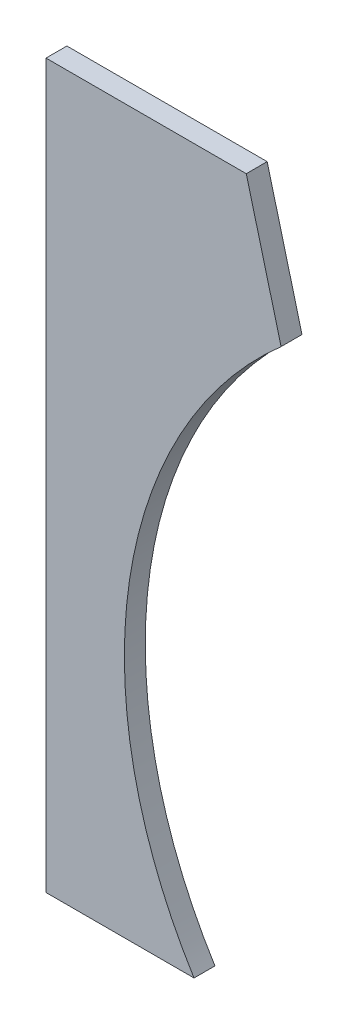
ISO-10303-21;
HEADER;
FILE_DESCRIPTION(('STEP AP214'),'2;1');
FILE_NAME('part.step','',(''),(''),'','','');
FILE_SCHEMA(('AUTOMOTIVE_DESIGN { 1 0 10303 214 1 1 1 1 }'));
ENDSEC;
DATA;
#1=APPLICATION_CONTEXT('core data for automotive mechanical design processes');
#2=APPLICATION_PROTOCOL_DEFINITION('international standard','automotive_design',2000,#1);
#3=PRODUCT_CONTEXT('',#1,'mechanical');
#4=PRODUCT('Part','Part','',(#3));
#5=PRODUCT_RELATED_PRODUCT_CATEGORY('part','',(#4));
#6=PRODUCT_DEFINITION_FORMATION('','',#4);
#7=PRODUCT_DEFINITION_CONTEXT('part definition',#1,'design');
#8=PRODUCT_DEFINITION('design','',#6,#7);
#9=PRODUCT_DEFINITION_SHAPE('','',#8);
#10=(LENGTH_UNIT() NAMED_UNIT(*) SI_UNIT(.MILLI.,.METRE.));
#11=(NAMED_UNIT(*) PLANE_ANGLE_UNIT() SI_UNIT($,.RADIAN.));
#12=(NAMED_UNIT(*) SI_UNIT($,.STERADIAN.) SOLID_ANGLE_UNIT());
#13=UNCERTAINTY_MEASURE_WITH_UNIT(LENGTH_MEASURE(1.E-05),#10,'distance_accuracy_value','');
#14=(GEOMETRIC_REPRESENTATION_CONTEXT(3) GLOBAL_UNCERTAINTY_ASSIGNED_CONTEXT((#13)) GLOBAL_UNIT_ASSIGNED_CONTEXT((#10,
#11,#12)) REPRESENTATION_CONTEXT('',''));
#15=CARTESIAN_POINT('',(0.,0.,0.));
#16=DIRECTION('',(0.,0.,1.));
#17=DIRECTION('',(1.,0.,0.));
#18=AXIS2_PLACEMENT_3D('',#15,#16,#17);
#19=CARTESIAN_POINT('',(310.,0.,12.));
#20=DIRECTION('',(0.,0.,-1.));
#21=DIRECTION('',(-1.,0.,0.));
#22=AXIS2_PLACEMENT_3D('',#19,#20,#21);
#23=CYLINDRICAL_SURFACE('',#22,265.);
#24=CARTESIAN_POINT('',(310.,0.,0.));
#25=DIRECTION('',(0.,0.,-1.));
#26=DIRECTION('',(1.,0.,0.));
#27=AXIS2_PLACEMENT_3D('',#24,#25,#26);
#28=CIRCLE('',#27,265.);
#29=CARTESIAN_POINT('',(85.,-140.,0.));
#30=VERTEX_POINT('',#29);
#31=CARTESIAN_POINT('',(135.,198.997487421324,0.));
#32=VERTEX_POINT('',#31);
#33=EDGE_CURVE('E80',#30,#32,#28,.T.);
#34=ORIENTED_EDGE('',*,*,#33,.T.);
#35=DIRECTION('',(0.,0.,-1.));
#36=VECTOR('',#35,1.);
#37=CARTESIAN_POINT('',(135.,198.997487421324,12.));
#38=LINE('',#37,#36);
#39=CARTESIAN_POINT('',(135.,198.997487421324,12.));
#40=VERTEX_POINT('',#39);
#41=EDGE_CURVE('E11',#40,#32,#38,.T.);
#42=ORIENTED_EDGE('',*,*,#41,.F.);
#43=CARTESIAN_POINT('',(310.,0.,12.));
#44=DIRECTION('',(0.,0.,-1.));
#45=DIRECTION('',(1.,0.,0.));
#46=AXIS2_PLACEMENT_3D('',#43,#44,#45);
#47=CIRCLE('',#46,265.);
#48=CARTESIAN_POINT('',(85.,-140.,12.));
#49=VERTEX_POINT('',#48);
#50=EDGE_CURVE('E101',#49,#40,#47,.T.);
#51=ORIENTED_EDGE('',*,*,#50,.F.);
#52=DIRECTION('',(0.,0.,-1.));
#53=VECTOR('',#52,1.);
#54=CARTESIAN_POINT('',(85.,-140.,12.));
#55=LINE('',#54,#53);
#56=EDGE_CURVE('E93',#49,#30,#55,.T.);
#57=ORIENTED_EDGE('',*,*,#56,.T.);
#58=EDGE_LOOP('',(#34,#42,#51,#57));
#59=FACE_BOUND('',#58,.T.);
#60=ADVANCED_FACE('F30',(#59),#23,.F.);
#61=CARTESIAN_POINT('',(115.,275.,12.));
#62=DIRECTION('',(-0.967076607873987,-0.254485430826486,0.));
#63=DIRECTION('',(0.254485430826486,-0.967076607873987,0.));
#64=AXIS2_PLACEMENT_3D('',#61,#62,#63);
#65=PLANE('',#64);
#66=DIRECTION('',(-0.254485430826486,0.967076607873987,0.));
#67=VECTOR('',#66,1.);
#68=CARTESIAN_POINT('',(115.,275.,0.));
#69=LINE('',#68,#67);
#70=CARTESIAN_POINT('',(115.,275.,0.));
#71=VERTEX_POINT('',#70);
#72=EDGE_CURVE('E76',#32,#71,#69,.T.);
#73=ORIENTED_EDGE('',*,*,#72,.T.);
#74=DIRECTION('',(0.,0.,-1.));
#75=VECTOR('',#74,1.);
#76=CARTESIAN_POINT('',(115.,275.,12.));
#77=LINE('',#76,#75);
#78=CARTESIAN_POINT('',(115.,275.,12.));
#79=VERTEX_POINT('',#78);
#80=EDGE_CURVE('E37',#79,#71,#77,.T.);
#81=ORIENTED_EDGE('',*,*,#80,.F.);
#82=DIRECTION('',(-0.254485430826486,0.967076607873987,0.));
#83=VECTOR('',#82,1.);
#84=CARTESIAN_POINT('',(115.,275.,12.));
#85=LINE('',#84,#83);
#86=EDGE_CURVE('E89',#40,#79,#85,.T.);
#87=ORIENTED_EDGE('',*,*,#86,.F.);
#88=ORIENTED_EDGE('',*,*,#41,.T.);
#89=EDGE_LOOP('',(#73,#81,#87,#88));
#90=FACE_BOUND('',#89,.T.);
#91=ADVANCED_FACE('F88',(#90),#65,.F.);
#92=CARTESIAN_POINT('',(0.,275.,12.));
#93=DIRECTION('',(0.,-1.,0.));
#94=DIRECTION('',(0.,0.,-1.));
#95=AXIS2_PLACEMENT_3D('',#92,#93,#94);
#96=PLANE('',#95);
#97=DIRECTION('',(-1.,0.,0.));
#98=VECTOR('',#97,1.);
#99=CARTESIAN_POINT('',(0.,275.,0.));
#100=LINE('',#99,#98);
#101=CARTESIAN_POINT('',(0.,275.,0.));
#102=VERTEX_POINT('',#101);
#103=EDGE_CURVE('E82',#71,#102,#100,.T.);
#104=ORIENTED_EDGE('',*,*,#103,.T.);
#105=DIRECTION('',(0.,0.,-1.));
#106=VECTOR('',#105,1.);
#107=CARTESIAN_POINT('',(0.,275.,12.));
#108=LINE('',#107,#106);
#109=CARTESIAN_POINT('',(0.,275.,12.));
#110=VERTEX_POINT('',#109);
#111=EDGE_CURVE('E112',#110,#102,#108,.T.);
#112=ORIENTED_EDGE('',*,*,#111,.F.);
#113=DIRECTION('',(-1.,0.,0.));
#114=VECTOR('',#113,1.);
#115=CARTESIAN_POINT('',(0.,275.,12.));
#116=LINE('',#115,#114);
#117=EDGE_CURVE('E104',#79,#110,#116,.T.);
#118=ORIENTED_EDGE('',*,*,#117,.F.);
#119=ORIENTED_EDGE('',*,*,#80,.T.);
#120=EDGE_LOOP('',(#104,#112,#118,#119));
#121=FACE_BOUND('',#120,.T.);
#122=ADVANCED_FACE('F116',(#121),#96,.F.);
#123=CARTESIAN_POINT('',(0.,-140.,12.));
#124=DIRECTION('',(1.,0.,0.));
#125=DIRECTION('',(0.,0.,-1.));
#126=AXIS2_PLACEMENT_3D('',#123,#124,#125);
#127=PLANE('',#126);
#128=DIRECTION('',(0.,-1.,0.));
#129=VECTOR('',#128,1.);
#130=CARTESIAN_POINT('',(0.,-140.,0.));
#131=LINE('',#130,#129);
#132=CARTESIAN_POINT('',(0.,-140.,0.));
#133=VERTEX_POINT('',#132);
#134=EDGE_CURVE('E97',#102,#133,#131,.T.);
#135=ORIENTED_EDGE('',*,*,#134,.T.);
#136=DIRECTION('',(0.,0.,-1.));
#137=VECTOR('',#136,1.);
#138=CARTESIAN_POINT('',(0.,-140.,12.));
#139=LINE('',#138,#137);
#140=CARTESIAN_POINT('',(0.,-140.,12.));
#141=VERTEX_POINT('',#140);
#142=EDGE_CURVE('E109',#141,#133,#139,.T.);
#143=ORIENTED_EDGE('',*,*,#142,.F.);
#144=DIRECTION('',(0.,-1.,0.));
#145=VECTOR('',#144,1.);
#146=CARTESIAN_POINT('',(0.,-140.,12.));
#147=LINE('',#146,#145);
#148=EDGE_CURVE('E49',#110,#141,#147,.T.);
#149=ORIENTED_EDGE('',*,*,#148,.F.);
#150=ORIENTED_EDGE('',*,*,#111,.T.);
#151=EDGE_LOOP('',(#135,#143,#149,#150));
#152=FACE_BOUND('',#151,.T.);
#153=ADVANCED_FACE('F127',(#152),#127,.F.);
#154=CARTESIAN_POINT('',(85.,-140.,12.));
#155=DIRECTION('',(0.,1.,0.));
#156=DIRECTION('',(0.,0.,1.));
#157=AXIS2_PLACEMENT_3D('',#154,#155,#156);
#158=PLANE('',#157);
#159=DIRECTION('',(1.,0.,0.));
#160=VECTOR('',#159,1.);
#161=CARTESIAN_POINT('',(85.,-140.,0.));
#162=LINE('',#161,#160);
#163=EDGE_CURVE('E99',#133,#30,#162,.T.);
#164=ORIENTED_EDGE('',*,*,#163,.T.);
#165=ORIENTED_EDGE('',*,*,#56,.F.);
#166=DIRECTION('',(1.,0.,0.));
#167=VECTOR('',#166,1.);
#168=CARTESIAN_POINT('',(85.,-140.,12.));
#169=LINE('',#168,#167);
#170=EDGE_CURVE('E44',#141,#49,#169,.T.);
#171=ORIENTED_EDGE('',*,*,#170,.F.);
#172=ORIENTED_EDGE('',*,*,#142,.T.);
#173=EDGE_LOOP('',(#164,#165,#171,#172));
#174=FACE_BOUND('',#173,.T.);
#175=ADVANCED_FACE('F120',(#174),#158,.F.);
#176=CARTESIAN_POINT('',(310.,0.,12.));
#177=DIRECTION('',(0.,0.,1.));
#178=DIRECTION('',(1.,0.,0.));
#179=AXIS2_PLACEMENT_3D('',#176,#177,#178);
#180=PLANE('',#179);
#181=ORIENTED_EDGE('',*,*,#50,.T.);
#182=ORIENTED_EDGE('',*,*,#86,.T.);
#183=ORIENTED_EDGE('',*,*,#117,.T.);
#184=ORIENTED_EDGE('',*,*,#148,.T.);
#185=ORIENTED_EDGE('',*,*,#170,.T.);
#186=EDGE_LOOP('',(#181,#182,#183,#184,#185));
#187=FACE_BOUND('',#186,.T.);
#188=ADVANCED_FACE('F118',(#187),#180,.T.);
#189=CARTESIAN_POINT('',(310.,0.,0.));
#190=DIRECTION('',(0.,0.,1.));
#191=DIRECTION('',(1.,0.,0.));
#192=AXIS2_PLACEMENT_3D('',#189,#190,#191);
#193=PLANE('',#192);
#194=ORIENTED_EDGE('',*,*,#33,.F.);
#195=ORIENTED_EDGE('',*,*,#163,.F.);
#196=ORIENTED_EDGE('',*,*,#134,.F.);
#197=ORIENTED_EDGE('',*,*,#103,.F.);
#198=ORIENTED_EDGE('',*,*,#72,.F.);
#199=EDGE_LOOP('',(#194,#195,#196,#197,#198));
#200=FACE_BOUND('',#199,.T.);
#201=ADVANCED_FACE('F77',(#200),#193,.F.);
#202=CLOSED_SHELL('',(#60,#91,#122,#153,#175,#188,#201));
#203=MANIFOLD_SOLID_BREP('B2',#202);
#204=ADVANCED_BREP_SHAPE_REPRESENTATION('',(#18,#203),#14);
#205=SHAPE_DEFINITION_REPRESENTATION(#9,#204);
ENDSEC;
END-ISO-10303-21;
